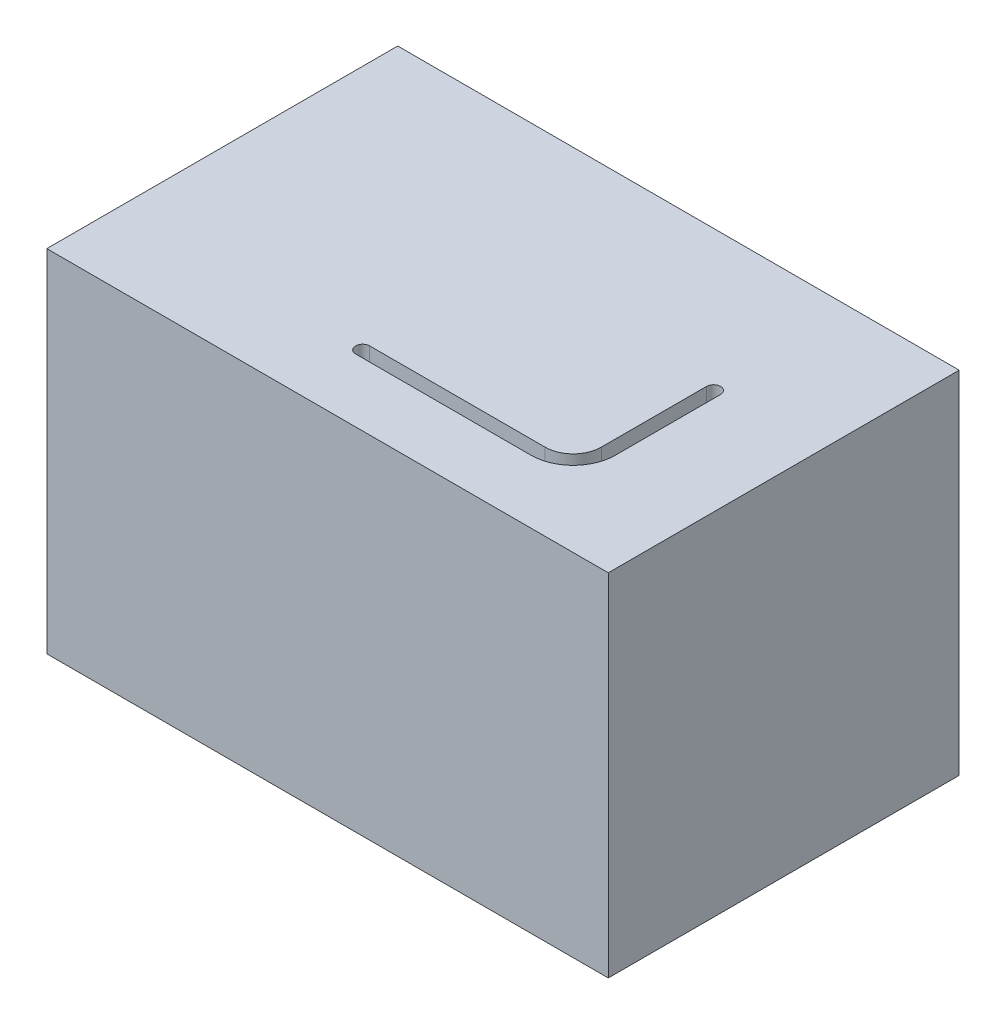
from build123d import *

# Parameters (mm, degrees)
SKETCH1_W          = 203.2
SKETCH1_H          = 127
EXTRUDE1_DEPTH     = 63.5
CUT_EXTRUDE1_DEPTH = 175.596133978


with BuildPart() as part:
    # Sketch1 → Extrude1 (new, symmetric)
    with BuildSketch(Plane(origin=(0, 0, 0), x_dir=(1, 0, 0), z_dir=(0, 1, 0))):
        Rectangle(SKETCH1_W, SKETCH1_H)
    extrude(amount=EXTRUDE1_DEPTH, both=True)

    # Sketch2 → Cut-Extrude1 (cut, through all)
    with BuildSketch(Plane(origin=(0, 63.5, 0), x_dir=(-1, 0, 0), z_dir=(0, 1, 0))):
        with BuildLine():
            Line((12.7, 40.64), (-50.8, 40.64))
            ThreePointArc((-50.8, 40.64), (-61.576307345, 36.176307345), (-66.04, 25.4))
            Line((-66.04, 25.4), (-66.04, -12.7))
            ThreePointArc((-66.04, -12.7), (-63.5, -15.24), (-60.96, -12.7))
            Line((-60.96, -12.7), (-60.96, 25.4))
            ThreePointArc((-60.96, 25.4), (-57.984204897, 32.584204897), (-50.8, 35.56))
            Line((-50.8, 35.56), (12.7, 35.56))
            ThreePointArc((12.7, 35.56), (15.24, 38.1), (12.7, 40.64))
        make_face()
    extrude(amount=-CUT_EXTRUDE1_DEPTH, mode=Mode.SUBTRACT)


solid = part.part
